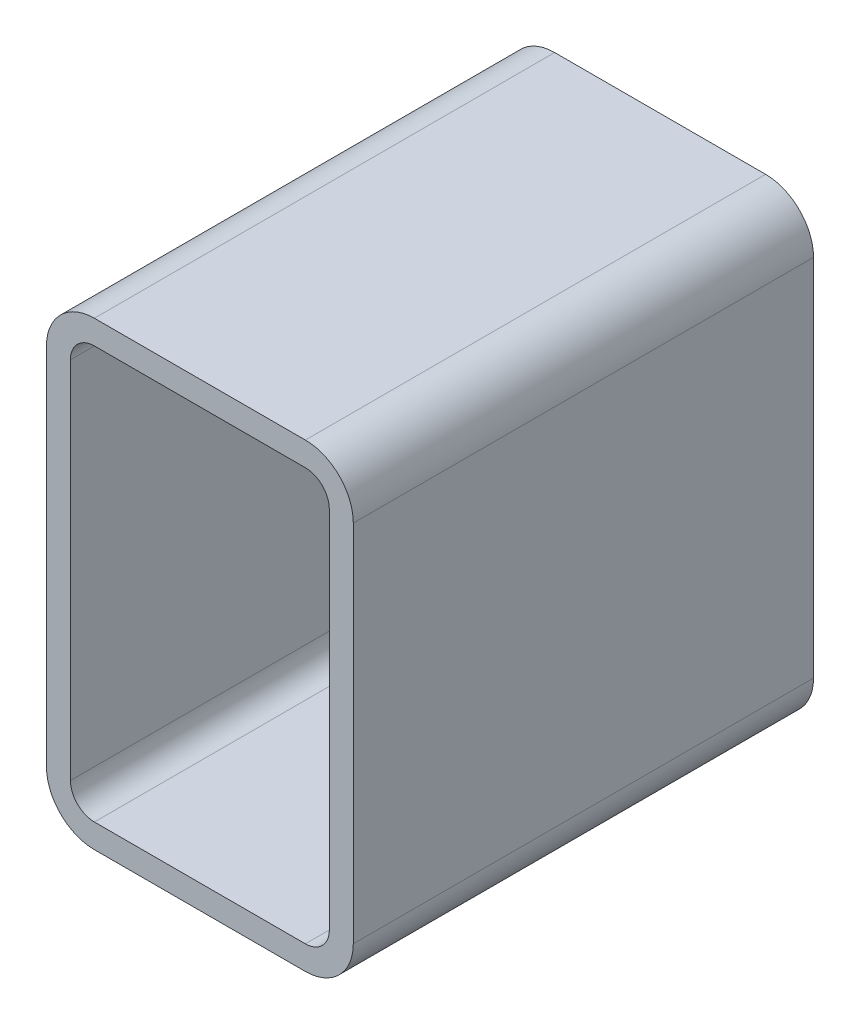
ISO-10303-21;
HEADER;
FILE_DESCRIPTION(('STEP AP214'),'2;1');
FILE_NAME('part.step','',(''),(''),'','','');
FILE_SCHEMA(('AUTOMOTIVE_DESIGN { 1 0 10303 214 1 1 1 1 }'));
ENDSEC;
DATA;
#1=APPLICATION_CONTEXT('core data for automotive mechanical design processes');
#2=APPLICATION_PROTOCOL_DEFINITION('international standard','automotive_design',2000,#1);
#3=PRODUCT_CONTEXT('',#1,'mechanical');
#4=PRODUCT('Part','Part','',(#3));
#5=PRODUCT_RELATED_PRODUCT_CATEGORY('part','',(#4));
#6=PRODUCT_DEFINITION_FORMATION('','',#4);
#7=PRODUCT_DEFINITION_CONTEXT('part definition',#1,'design');
#8=PRODUCT_DEFINITION('design','',#6,#7);
#9=PRODUCT_DEFINITION_SHAPE('','',#8);
#10=(LENGTH_UNIT() NAMED_UNIT(*) SI_UNIT(.MILLI.,.METRE.));
#11=(NAMED_UNIT(*) PLANE_ANGLE_UNIT() SI_UNIT($,.RADIAN.));
#12=(NAMED_UNIT(*) SI_UNIT($,.STERADIAN.) SOLID_ANGLE_UNIT());
#13=UNCERTAINTY_MEASURE_WITH_UNIT(LENGTH_MEASURE(1.E-05),#10,'distance_accuracy_value','');
#14=(GEOMETRIC_REPRESENTATION_CONTEXT(3) GLOBAL_UNCERTAINTY_ASSIGNED_CONTEXT((#13)) GLOBAL_UNIT_ASSIGNED_CONTEXT((#10,
#11,#12)) REPRESENTATION_CONTEXT('',''));
#15=CARTESIAN_POINT('',(0.,0.,0.));
#16=DIRECTION('',(0.,0.,1.));
#17=DIRECTION('',(1.,0.,0.));
#18=AXIS2_PLACEMENT_3D('',#15,#16,#17);
#19=CARTESIAN_POINT('',(33.1409404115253,274.924496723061,304.8));
#20=DIRECTION('',(0.,0.,1.));
#21=DIRECTION('',(1.,0.,0.));
#22=AXIS2_PLACEMENT_3D('',#19,#20,#21);
#23=PLANE('',#22);
#24=CARTESIAN_POINT('',(33.1409404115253,274.924496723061,304.8));
#25=DIRECTION('',(0.,0.,1.));
#26=DIRECTION('',(1.,0.,0.));
#27=AXIS2_PLACEMENT_3D('',#24,#25,#26);
#28=CIRCLE('',#27,31.75);
#29=CARTESIAN_POINT('',(33.1409404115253,306.674496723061,304.8));
#30=VERTEX_POINT('',#29);
#31=CARTESIAN_POINT('',(1.3909404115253,274.924496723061,304.8));
#32=VERTEX_POINT('',#31);
#33=EDGE_CURVE('E211',#30,#32,#28,.T.);
#34=ORIENTED_EDGE('',*,*,#33,.T.);
#35=DIRECTION('',(0.,-1.,0.));
#36=VECTOR('',#35,1.);
#37=CARTESIAN_POINT('',(1.3909404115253,33.6244967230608,304.8));
#38=LINE('',#37,#36);
#39=CARTESIAN_POINT('',(1.3909404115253,33.6244967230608,304.8));
#40=VERTEX_POINT('',#39);
#41=EDGE_CURVE('E214',#32,#40,#38,.T.);
#42=ORIENTED_EDGE('',*,*,#41,.T.);
#43=CARTESIAN_POINT('',(33.1409404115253,33.6244967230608,304.8));
#44=DIRECTION('',(0.,0.,1.));
#45=DIRECTION('',(1.,0.,0.));
#46=AXIS2_PLACEMENT_3D('',#43,#44,#45);
#47=CIRCLE('',#46,31.75);
#48=CARTESIAN_POINT('',(33.1409404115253,1.87449672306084,304.8));
#49=VERTEX_POINT('',#48);
#50=EDGE_CURVE('E217',#40,#49,#47,.T.);
#51=ORIENTED_EDGE('',*,*,#50,.T.);
#52=DIRECTION('',(1.,0.,0.));
#53=VECTOR('',#52,1.);
#54=CARTESIAN_POINT('',(172.840940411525,1.87449672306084,304.8));
#55=LINE('',#54,#53);
#56=CARTESIAN_POINT('',(172.840940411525,1.87449672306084,304.8));
#57=VERTEX_POINT('',#56);
#58=EDGE_CURVE('E219',#49,#57,#55,.T.);
#59=ORIENTED_EDGE('',*,*,#58,.T.);
#60=CARTESIAN_POINT('',(172.840940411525,33.6244967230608,304.8));
#61=DIRECTION('',(0.,0.,1.));
#62=DIRECTION('',(1.,0.,0.));
#63=AXIS2_PLACEMENT_3D('',#60,#61,#62);
#64=CIRCLE('',#63,31.75);
#65=CARTESIAN_POINT('',(204.590940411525,33.6244967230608,304.8));
#66=VERTEX_POINT('',#65);
#67=EDGE_CURVE('E221',#57,#66,#64,.T.);
#68=ORIENTED_EDGE('',*,*,#67,.T.);
#69=DIRECTION('',(0.,1.,0.));
#70=VECTOR('',#69,1.);
#71=CARTESIAN_POINT('',(204.590940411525,274.924496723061,304.8));
#72=LINE('',#71,#70);
#73=CARTESIAN_POINT('',(204.590940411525,274.924496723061,304.8));
#74=VERTEX_POINT('',#73);
#75=EDGE_CURVE('E223',#66,#74,#72,.T.);
#76=ORIENTED_EDGE('',*,*,#75,.T.);
#77=CARTESIAN_POINT('',(172.840940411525,274.924496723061,304.8));
#78=DIRECTION('',(0.,0.,1.));
#79=DIRECTION('',(1.,0.,0.));
#80=AXIS2_PLACEMENT_3D('',#77,#78,#79);
#81=CIRCLE('',#80,31.75);
#82=CARTESIAN_POINT('',(172.840940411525,306.674496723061,304.8));
#83=VERTEX_POINT('',#82);
#84=EDGE_CURVE('E225',#74,#83,#81,.T.);
#85=ORIENTED_EDGE('',*,*,#84,.T.);
#86=DIRECTION('',(-1.,0.,0.));
#87=VECTOR('',#86,1.);
#88=CARTESIAN_POINT('',(33.1409404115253,306.674496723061,304.8));
#89=LINE('',#88,#87);
#90=EDGE_CURVE('E227',#83,#30,#89,.T.);
#91=ORIENTED_EDGE('',*,*,#90,.T.);
#92=EDGE_LOOP('',(#34,#42,#51,#59,#68,#76,#85,#91));
#93=FACE_BOUND('',#92,.T.);
#94=DIRECTION('',(0.,-1.,0.));
#95=VECTOR('',#94,1.);
#96=CARTESIAN_POINT('',(17.2659404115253,33.6244967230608,304.8));
#97=LINE('',#96,#95);
#98=CARTESIAN_POINT('',(17.2659404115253,274.924496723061,304.8));
#99=VERTEX_POINT('',#98);
#100=CARTESIAN_POINT('',(17.2659404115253,33.6244967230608,304.8));
#101=VERTEX_POINT('',#100);
#102=EDGE_CURVE('E154',#99,#101,#97,.T.);
#103=ORIENTED_EDGE('',*,*,#102,.F.);
#104=CARTESIAN_POINT('',(33.1409404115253,274.924496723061,304.8));
#105=DIRECTION('',(0.,0.,1.));
#106=DIRECTION('',(1.,0.,0.));
#107=AXIS2_PLACEMENT_3D('',#104,#105,#106);
#108=CIRCLE('',#107,15.875);
#109=CARTESIAN_POINT('',(33.1409404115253,290.799496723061,304.8));
#110=VERTEX_POINT('',#109);
#111=EDGE_CURVE('E146',#110,#99,#108,.T.);
#112=ORIENTED_EDGE('',*,*,#111,.F.);
#113=DIRECTION('',(-1.,0.,0.));
#114=VECTOR('',#113,1.);
#115=CARTESIAN_POINT('',(33.1409404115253,290.799496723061,304.8));
#116=LINE('',#115,#114);
#117=CARTESIAN_POINT('',(172.840940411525,290.799496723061,304.8));
#118=VERTEX_POINT('',#117);
#119=EDGE_CURVE('E179',#118,#110,#116,.T.);
#120=ORIENTED_EDGE('',*,*,#119,.F.);
#121=CARTESIAN_POINT('',(172.840940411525,274.924496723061,304.8));
#122=DIRECTION('',(0.,0.,1.));
#123=DIRECTION('',(1.,0.,0.));
#124=AXIS2_PLACEMENT_3D('',#121,#122,#123);
#125=CIRCLE('',#124,15.875);
#126=CARTESIAN_POINT('',(188.715940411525,274.924496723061,304.8));
#127=VERTEX_POINT('',#126);
#128=EDGE_CURVE('E177',#127,#118,#125,.T.);
#129=ORIENTED_EDGE('',*,*,#128,.F.);
#130=DIRECTION('',(0.,1.,0.));
#131=VECTOR('',#130,1.);
#132=CARTESIAN_POINT('',(188.715940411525,274.924496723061,304.8));
#133=LINE('',#132,#131);
#134=CARTESIAN_POINT('',(188.715940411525,33.6244967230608,304.8));
#135=VERTEX_POINT('',#134);
#136=EDGE_CURVE('E175',#135,#127,#133,.T.);
#137=ORIENTED_EDGE('',*,*,#136,.F.);
#138=CARTESIAN_POINT('',(172.840940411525,33.6244967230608,304.8));
#139=DIRECTION('',(0.,0.,1.));
#140=DIRECTION('',(1.,0.,0.));
#141=AXIS2_PLACEMENT_3D('',#138,#139,#140);
#142=CIRCLE('',#141,15.875);
#143=CARTESIAN_POINT('',(172.840940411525,17.7494967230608,304.8));
#144=VERTEX_POINT('',#143);
#145=EDGE_CURVE('E173',#144,#135,#142,.T.);
#146=ORIENTED_EDGE('',*,*,#145,.F.);
#147=DIRECTION('',(1.,0.,0.));
#148=VECTOR('',#147,1.);
#149=CARTESIAN_POINT('',(172.840940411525,17.7494967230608,304.8));
#150=LINE('',#149,#148);
#151=CARTESIAN_POINT('',(33.1409404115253,17.7494967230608,304.8));
#152=VERTEX_POINT('',#151);
#153=EDGE_CURVE('E169',#152,#144,#150,.T.);
#154=ORIENTED_EDGE('',*,*,#153,.F.);
#155=CARTESIAN_POINT('',(33.1409404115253,33.6244967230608,304.8));
#156=DIRECTION('',(0.,0.,1.));
#157=DIRECTION('',(1.,0.,0.));
#158=AXIS2_PLACEMENT_3D('',#155,#156,#157);
#159=CIRCLE('',#158,15.875);
#160=EDGE_CURVE('E167',#101,#152,#159,.T.);
#161=ORIENTED_EDGE('',*,*,#160,.F.);
#162=EDGE_LOOP('',(#103,#112,#120,#129,#137,#146,#154,#161));
#163=FACE_BOUND('',#162,.T.);
#164=ADVANCED_FACE('F33',(#93,#163),#23,.T.);
#165=CARTESIAN_POINT('',(33.1409404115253,274.924496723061,0.));
#166=DIRECTION('',(0.,0.,1.));
#167=DIRECTION('',(1.,0.,0.));
#168=AXIS2_PLACEMENT_3D('',#165,#166,#167);
#169=PLANE('',#168);
#170=CARTESIAN_POINT('',(33.1409404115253,274.924496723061,0.));
#171=DIRECTION('',(0.,0.,1.));
#172=DIRECTION('',(1.,0.,0.));
#173=AXIS2_PLACEMENT_3D('',#170,#171,#172);
#174=CIRCLE('',#173,31.75);
#175=CARTESIAN_POINT('',(33.1409404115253,306.674496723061,0.));
#176=VERTEX_POINT('',#175);
#177=CARTESIAN_POINT('',(1.3909404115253,274.924496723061,0.));
#178=VERTEX_POINT('',#177);
#179=EDGE_CURVE('E162',#176,#178,#174,.T.);
#180=ORIENTED_EDGE('',*,*,#179,.F.);
#181=DIRECTION('',(-1.,0.,0.));
#182=VECTOR('',#181,1.);
#183=CARTESIAN_POINT('',(33.1409404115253,306.674496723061,0.));
#184=LINE('',#183,#182);
#185=CARTESIAN_POINT('',(172.840940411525,306.674496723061,0.));
#186=VERTEX_POINT('',#185);
#187=EDGE_CURVE('E215',#186,#176,#184,.T.);
#188=ORIENTED_EDGE('',*,*,#187,.F.);
#189=CARTESIAN_POINT('',(172.840940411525,274.924496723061,0.));
#190=DIRECTION('',(0.,0.,1.));
#191=DIRECTION('',(1.,0.,0.));
#192=AXIS2_PLACEMENT_3D('',#189,#190,#191);
#193=CIRCLE('',#192,31.75);
#194=CARTESIAN_POINT('',(204.590940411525,274.924496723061,0.));
#195=VERTEX_POINT('',#194);
#196=EDGE_CURVE('E242',#195,#186,#193,.T.);
#197=ORIENTED_EDGE('',*,*,#196,.F.);
#198=DIRECTION('',(0.,1.,0.));
#199=VECTOR('',#198,1.);
#200=CARTESIAN_POINT('',(204.590940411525,274.924496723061,0.));
#201=LINE('',#200,#199);
#202=CARTESIAN_POINT('',(204.590940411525,33.6244967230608,0.));
#203=VERTEX_POINT('',#202);
#204=EDGE_CURVE('E240',#203,#195,#201,.T.);
#205=ORIENTED_EDGE('',*,*,#204,.F.);
#206=CARTESIAN_POINT('',(172.840940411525,33.6244967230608,0.));
#207=DIRECTION('',(0.,0.,1.));
#208=DIRECTION('',(1.,0.,0.));
#209=AXIS2_PLACEMENT_3D('',#206,#207,#208);
#210=CIRCLE('',#209,31.75);
#211=CARTESIAN_POINT('',(172.840940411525,1.87449672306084,0.));
#212=VERTEX_POINT('',#211);
#213=EDGE_CURVE('E238',#212,#203,#210,.T.);
#214=ORIENTED_EDGE('',*,*,#213,.F.);
#215=DIRECTION('',(1.,0.,0.));
#216=VECTOR('',#215,1.);
#217=CARTESIAN_POINT('',(172.840940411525,1.87449672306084,0.));
#218=LINE('',#217,#216);
#219=CARTESIAN_POINT('',(33.1409404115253,1.87449672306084,0.));
#220=VERTEX_POINT('',#219);
#221=EDGE_CURVE('E236',#220,#212,#218,.T.);
#222=ORIENTED_EDGE('',*,*,#221,.F.);
#223=CARTESIAN_POINT('',(33.1409404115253,33.6244967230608,0.));
#224=DIRECTION('',(0.,0.,1.));
#225=DIRECTION('',(1.,0.,0.));
#226=AXIS2_PLACEMENT_3D('',#223,#224,#225);
#227=CIRCLE('',#226,31.75);
#228=CARTESIAN_POINT('',(1.3909404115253,33.6244967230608,0.));
#229=VERTEX_POINT('',#228);
#230=EDGE_CURVE('E234',#229,#220,#227,.T.);
#231=ORIENTED_EDGE('',*,*,#230,.F.);
#232=DIRECTION('',(0.,-1.,0.));
#233=VECTOR('',#232,1.);
#234=CARTESIAN_POINT('',(1.3909404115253,33.6244967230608,0.));
#235=LINE('',#234,#233);
#236=EDGE_CURVE('E232',#178,#229,#235,.T.);
#237=ORIENTED_EDGE('',*,*,#236,.F.);
#238=EDGE_LOOP('',(#180,#188,#197,#205,#214,#222,#231,#237));
#239=FACE_BOUND('',#238,.T.);
#240=CARTESIAN_POINT('',(33.1409404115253,274.924496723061,0.));
#241=DIRECTION('',(0.,0.,1.));
#242=DIRECTION('',(1.,0.,0.));
#243=AXIS2_PLACEMENT_3D('',#240,#241,#242);
#244=CIRCLE('',#243,15.875);
#245=CARTESIAN_POINT('',(33.1409404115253,290.799496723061,0.));
#246=VERTEX_POINT('',#245);
#247=CARTESIAN_POINT('',(17.2659404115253,274.924496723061,0.));
#248=VERTEX_POINT('',#247);
#249=EDGE_CURVE('E56',#246,#248,#244,.T.);
#250=ORIENTED_EDGE('',*,*,#249,.T.);
#251=DIRECTION('',(0.,-1.,0.));
#252=VECTOR('',#251,1.);
#253=CARTESIAN_POINT('',(17.2659404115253,33.6244967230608,0.));
#254=LINE('',#253,#252);
#255=CARTESIAN_POINT('',(17.2659404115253,33.6244967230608,0.));
#256=VERTEX_POINT('',#255);
#257=EDGE_CURVE('E161',#248,#256,#254,.T.);
#258=ORIENTED_EDGE('',*,*,#257,.T.);
#259=CARTESIAN_POINT('',(33.1409404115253,33.6244967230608,0.));
#260=DIRECTION('',(0.,0.,1.));
#261=DIRECTION('',(1.,0.,0.));
#262=AXIS2_PLACEMENT_3D('',#259,#260,#261);
#263=CIRCLE('',#262,15.875);
#264=CARTESIAN_POINT('',(33.1409404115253,17.7494967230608,0.));
#265=VERTEX_POINT('',#264);
#266=EDGE_CURVE('E183',#256,#265,#263,.T.);
#267=ORIENTED_EDGE('',*,*,#266,.T.);
#268=DIRECTION('',(1.,0.,0.));
#269=VECTOR('',#268,1.);
#270=CARTESIAN_POINT('',(172.840940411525,17.7494967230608,0.));
#271=LINE('',#270,#269);
#272=CARTESIAN_POINT('',(172.840940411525,17.7494967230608,0.));
#273=VERTEX_POINT('',#272);
#274=EDGE_CURVE('E186',#265,#273,#271,.T.);
#275=ORIENTED_EDGE('',*,*,#274,.T.);
#276=CARTESIAN_POINT('',(172.840940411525,33.6244967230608,0.));
#277=DIRECTION('',(0.,0.,1.));
#278=DIRECTION('',(1.,0.,0.));
#279=AXIS2_PLACEMENT_3D('',#276,#277,#278);
#280=CIRCLE('',#279,15.875);
#281=CARTESIAN_POINT('',(188.715940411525,33.6244967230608,0.));
#282=VERTEX_POINT('',#281);
#283=EDGE_CURVE('E189',#273,#282,#280,.T.);
#284=ORIENTED_EDGE('',*,*,#283,.T.);
#285=DIRECTION('',(0.,1.,0.));
#286=VECTOR('',#285,1.);
#287=CARTESIAN_POINT('',(188.715940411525,274.924496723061,0.));
#288=LINE('',#287,#286);
#289=CARTESIAN_POINT('',(188.715940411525,274.924496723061,0.));
#290=VERTEX_POINT('',#289);
#291=EDGE_CURVE('E192',#282,#290,#288,.T.);
#292=ORIENTED_EDGE('',*,*,#291,.T.);
#293=CARTESIAN_POINT('',(172.840940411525,274.924496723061,0.));
#294=DIRECTION('',(0.,0.,1.));
#295=DIRECTION('',(1.,0.,0.));
#296=AXIS2_PLACEMENT_3D('',#293,#294,#295);
#297=CIRCLE('',#296,15.875);
#298=CARTESIAN_POINT('',(172.840940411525,290.799496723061,0.));
#299=VERTEX_POINT('',#298);
#300=EDGE_CURVE('E195',#290,#299,#297,.T.);
#301=ORIENTED_EDGE('',*,*,#300,.T.);
#302=DIRECTION('',(-1.,0.,0.));
#303=VECTOR('',#302,1.);
#304=CARTESIAN_POINT('',(33.1409404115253,290.799496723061,0.));
#305=LINE('',#304,#303);
#306=EDGE_CURVE('E155',#299,#246,#305,.T.);
#307=ORIENTED_EDGE('',*,*,#306,.T.);
#308=EDGE_LOOP('',(#250,#258,#267,#275,#284,#292,#301,#307));
#309=FACE_BOUND('',#308,.T.);
#310=ADVANCED_FACE('F272',(#239,#309),#169,.F.);
#311=CARTESIAN_POINT('',(33.1409404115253,274.924496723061,304.8));
#312=DIRECTION('',(0.,0.,-1.));
#313=DIRECTION('',(-1.,0.,0.));
#314=AXIS2_PLACEMENT_3D('',#311,#312,#313);
#315=CYLINDRICAL_SURFACE('',#314,31.75);
#316=ORIENTED_EDGE('',*,*,#179,.T.);
#317=DIRECTION('',(0.,0.,-1.));
#318=VECTOR('',#317,1.);
#319=CARTESIAN_POINT('',(1.3909404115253,274.924496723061,304.8));
#320=LINE('',#319,#318);
#321=EDGE_CURVE('E11',#32,#178,#320,.T.);
#322=ORIENTED_EDGE('',*,*,#321,.F.);
#323=ORIENTED_EDGE('',*,*,#33,.F.);
#324=DIRECTION('',(0.,0.,-1.));
#325=VECTOR('',#324,1.);
#326=CARTESIAN_POINT('',(33.1409404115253,306.674496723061,304.8));
#327=LINE('',#326,#325);
#328=EDGE_CURVE('E229',#30,#176,#327,.T.);
#329=ORIENTED_EDGE('',*,*,#328,.T.);
#330=EDGE_LOOP('',(#316,#322,#323,#329));
#331=FACE_BOUND('',#330,.T.);
#332=ADVANCED_FACE('F35',(#331),#315,.T.);
#333=CARTESIAN_POINT('',(1.3909404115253,33.6244967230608,304.8));
#334=DIRECTION('',(1.,0.,0.));
#335=DIRECTION('',(0.,0.,-1.));
#336=AXIS2_PLACEMENT_3D('',#333,#334,#335);
#337=PLANE('',#336);
#338=ORIENTED_EDGE('',*,*,#236,.T.);
#339=DIRECTION('',(0.,0.,-1.));
#340=VECTOR('',#339,1.);
#341=CARTESIAN_POINT('',(1.3909404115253,33.6244967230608,304.8));
#342=LINE('',#341,#340);
#343=EDGE_CURVE('E41',#40,#229,#342,.T.);
#344=ORIENTED_EDGE('',*,*,#343,.F.);
#345=ORIENTED_EDGE('',*,*,#41,.F.);
#346=ORIENTED_EDGE('',*,*,#321,.T.);
#347=EDGE_LOOP('',(#338,#344,#345,#346));
#348=FACE_BOUND('',#347,.T.);
#349=ADVANCED_FACE('F289',(#348),#337,.F.);
#350=CARTESIAN_POINT('',(33.1409404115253,33.6244967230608,304.8));
#351=DIRECTION('',(0.,0.,-1.));
#352=DIRECTION('',(-1.,0.,0.));
#353=AXIS2_PLACEMENT_3D('',#350,#351,#352);
#354=CYLINDRICAL_SURFACE('',#353,31.75);
#355=ORIENTED_EDGE('',*,*,#230,.T.);
#356=DIRECTION('',(0.,0.,-1.));
#357=VECTOR('',#356,1.);
#358=CARTESIAN_POINT('',(33.1409404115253,1.87449672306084,304.8));
#359=LINE('',#358,#357);
#360=EDGE_CURVE('E259',#49,#220,#359,.T.);
#361=ORIENTED_EDGE('',*,*,#360,.F.);
#362=ORIENTED_EDGE('',*,*,#50,.F.);
#363=ORIENTED_EDGE('',*,*,#343,.T.);
#364=EDGE_LOOP('',(#355,#361,#362,#363));
#365=FACE_BOUND('',#364,.T.);
#366=ADVANCED_FACE('F266',(#365),#354,.T.);
#367=CARTESIAN_POINT('',(172.840940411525,1.87449672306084,304.8));
#368=DIRECTION('',(0.,1.,0.));
#369=DIRECTION('',(0.,0.,1.));
#370=AXIS2_PLACEMENT_3D('',#367,#368,#369);
#371=PLANE('',#370);
#372=ORIENTED_EDGE('',*,*,#221,.T.);
#373=DIRECTION('',(0.,0.,-1.));
#374=VECTOR('',#373,1.);
#375=CARTESIAN_POINT('',(172.840940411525,1.87449672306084,304.8));
#376=LINE('',#375,#374);
#377=EDGE_CURVE('E256',#57,#212,#376,.T.);
#378=ORIENTED_EDGE('',*,*,#377,.F.);
#379=ORIENTED_EDGE('',*,*,#58,.F.);
#380=ORIENTED_EDGE('',*,*,#360,.T.);
#381=EDGE_LOOP('',(#372,#378,#379,#380));
#382=FACE_BOUND('',#381,.T.);
#383=ADVANCED_FACE('F278',(#382),#371,.F.);
#384=CARTESIAN_POINT('',(172.840940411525,33.6244967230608,304.8));
#385=DIRECTION('',(0.,0.,-1.));
#386=DIRECTION('',(-1.,0.,0.));
#387=AXIS2_PLACEMENT_3D('',#384,#385,#386);
#388=CYLINDRICAL_SURFACE('',#387,31.75);
#389=ORIENTED_EDGE('',*,*,#213,.T.);
#390=DIRECTION('',(0.,0.,-1.));
#391=VECTOR('',#390,1.);
#392=CARTESIAN_POINT('',(204.590940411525,33.6244967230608,304.8));
#393=LINE('',#392,#391);
#394=EDGE_CURVE('E253',#66,#203,#393,.T.);
#395=ORIENTED_EDGE('',*,*,#394,.F.);
#396=ORIENTED_EDGE('',*,*,#67,.F.);
#397=ORIENTED_EDGE('',*,*,#377,.T.);
#398=EDGE_LOOP('',(#389,#395,#396,#397));
#399=FACE_BOUND('',#398,.T.);
#400=ADVANCED_FACE('F282',(#399),#388,.T.);
#401=CARTESIAN_POINT('',(204.590940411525,274.924496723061,304.8));
#402=DIRECTION('',(-1.,0.,0.));
#403=DIRECTION('',(0.,0.,1.));
#404=AXIS2_PLACEMENT_3D('',#401,#402,#403);
#405=PLANE('',#404);
#406=ORIENTED_EDGE('',*,*,#204,.T.);
#407=DIRECTION('',(0.,0.,-1.));
#408=VECTOR('',#407,1.);
#409=CARTESIAN_POINT('',(204.590940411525,274.924496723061,304.8));
#410=LINE('',#409,#408);
#411=EDGE_CURVE('E250',#74,#195,#410,.T.);
#412=ORIENTED_EDGE('',*,*,#411,.F.);
#413=ORIENTED_EDGE('',*,*,#75,.F.);
#414=ORIENTED_EDGE('',*,*,#394,.T.);
#415=EDGE_LOOP('',(#406,#412,#413,#414));
#416=FACE_BOUND('',#415,.T.);
#417=ADVANCED_FACE('F302',(#416),#405,.F.);
#418=CARTESIAN_POINT('',(172.840940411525,274.924496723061,304.8));
#419=DIRECTION('',(0.,0.,-1.));
#420=DIRECTION('',(-1.,0.,0.));
#421=AXIS2_PLACEMENT_3D('',#418,#419,#420);
#422=CYLINDRICAL_SURFACE('',#421,31.75);
#423=ORIENTED_EDGE('',*,*,#196,.T.);
#424=DIRECTION('',(0.,0.,-1.));
#425=VECTOR('',#424,1.);
#426=CARTESIAN_POINT('',(172.840940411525,306.674496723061,304.8));
#427=LINE('',#426,#425);
#428=EDGE_CURVE('E247',#83,#186,#427,.T.);
#429=ORIENTED_EDGE('',*,*,#428,.F.);
#430=ORIENTED_EDGE('',*,*,#84,.F.);
#431=ORIENTED_EDGE('',*,*,#411,.T.);
#432=EDGE_LOOP('',(#423,#429,#430,#431));
#433=FACE_BOUND('',#432,.T.);
#434=ADVANCED_FACE('F300',(#433),#422,.T.);
#435=CARTESIAN_POINT('',(33.1409404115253,306.674496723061,304.8));
#436=DIRECTION('',(0.,-1.,0.));
#437=DIRECTION('',(0.,0.,-1.));
#438=AXIS2_PLACEMENT_3D('',#435,#436,#437);
#439=PLANE('',#438);
#440=ORIENTED_EDGE('',*,*,#187,.T.);
#441=ORIENTED_EDGE('',*,*,#328,.F.);
#442=ORIENTED_EDGE('',*,*,#90,.F.);
#443=ORIENTED_EDGE('',*,*,#428,.T.);
#444=EDGE_LOOP('',(#440,#441,#442,#443));
#445=FACE_BOUND('',#444,.T.);
#446=ADVANCED_FACE('F295',(#445),#439,.F.);
#447=CARTESIAN_POINT('',(33.1409404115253,274.924496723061,304.8));
#448=DIRECTION('',(0.,0.,-1.));
#449=DIRECTION('',(-1.,0.,0.));
#450=AXIS2_PLACEMENT_3D('',#447,#448,#449);
#451=CYLINDRICAL_SURFACE('',#450,15.875);
#452=ORIENTED_EDGE('',*,*,#249,.F.);
#453=DIRECTION('',(0.,0.,-1.));
#454=VECTOR('',#453,1.);
#455=CARTESIAN_POINT('',(33.1409404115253,290.799496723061,304.8));
#456=LINE('',#455,#454);
#457=EDGE_CURVE('E150',#110,#246,#456,.T.);
#458=ORIENTED_EDGE('',*,*,#457,.F.);
#459=ORIENTED_EDGE('',*,*,#111,.T.);
#460=DIRECTION('',(0.,0.,-1.));
#461=VECTOR('',#460,1.);
#462=CARTESIAN_POINT('',(17.2659404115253,274.924496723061,304.8));
#463=LINE('',#462,#461);
#464=EDGE_CURVE('E149',#99,#248,#463,.T.);
#465=ORIENTED_EDGE('',*,*,#464,.T.);
#466=EDGE_LOOP('',(#452,#458,#459,#465));
#467=FACE_BOUND('',#466,.T.);
#468=ADVANCED_FACE('F148',(#467),#451,.F.);
#469=CARTESIAN_POINT('',(17.2659404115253,33.6244967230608,304.8));
#470=DIRECTION('',(1.,0.,0.));
#471=DIRECTION('',(0.,0.,-1.));
#472=AXIS2_PLACEMENT_3D('',#469,#470,#471);
#473=PLANE('',#472);
#474=ORIENTED_EDGE('',*,*,#257,.F.);
#475=ORIENTED_EDGE('',*,*,#464,.F.);
#476=ORIENTED_EDGE('',*,*,#102,.T.);
#477=DIRECTION('',(0.,0.,-1.));
#478=VECTOR('',#477,1.);
#479=CARTESIAN_POINT('',(17.2659404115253,33.6244967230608,304.8));
#480=LINE('',#479,#478);
#481=EDGE_CURVE('E163',#101,#256,#480,.T.);
#482=ORIENTED_EDGE('',*,*,#481,.T.);
#483=EDGE_LOOP('',(#474,#475,#476,#482));
#484=FACE_BOUND('',#483,.T.);
#485=ADVANCED_FACE('F158',(#484),#473,.T.);
#486=CARTESIAN_POINT('',(33.1409404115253,33.6244967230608,304.8));
#487=DIRECTION('',(0.,0.,-1.));
#488=DIRECTION('',(-1.,0.,0.));
#489=AXIS2_PLACEMENT_3D('',#486,#487,#488);
#490=CYLINDRICAL_SURFACE('',#489,15.875);
#491=ORIENTED_EDGE('',*,*,#266,.F.);
#492=ORIENTED_EDGE('',*,*,#481,.F.);
#493=ORIENTED_EDGE('',*,*,#160,.T.);
#494=DIRECTION('',(0.,0.,-1.));
#495=VECTOR('',#494,1.);
#496=CARTESIAN_POINT('',(33.1409404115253,17.7494967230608,304.8));
#497=LINE('',#496,#495);
#498=EDGE_CURVE('E208',#152,#265,#497,.T.);
#499=ORIENTED_EDGE('',*,*,#498,.T.);
#500=EDGE_LOOP('',(#491,#492,#493,#499));
#501=FACE_BOUND('',#500,.T.);
#502=ADVANCED_FACE('F327',(#501),#490,.F.);
#503=CARTESIAN_POINT('',(172.840940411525,17.7494967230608,304.8));
#504=DIRECTION('',(0.,1.,0.));
#505=DIRECTION('',(0.,0.,1.));
#506=AXIS2_PLACEMENT_3D('',#503,#504,#505);
#507=PLANE('',#506);
#508=ORIENTED_EDGE('',*,*,#274,.F.);
#509=ORIENTED_EDGE('',*,*,#498,.F.);
#510=ORIENTED_EDGE('',*,*,#153,.T.);
#511=DIRECTION('',(0.,0.,-1.));
#512=VECTOR('',#511,1.);
#513=CARTESIAN_POINT('',(172.840940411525,17.7494967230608,304.8));
#514=LINE('',#513,#512);
#515=EDGE_CURVE('E206',#144,#273,#514,.T.);
#516=ORIENTED_EDGE('',*,*,#515,.T.);
#517=EDGE_LOOP('',(#508,#509,#510,#516));
#518=FACE_BOUND('',#517,.T.);
#519=ADVANCED_FACE('F331',(#518),#507,.T.);
#520=CARTESIAN_POINT('',(172.840940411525,33.6244967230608,304.8));
#521=DIRECTION('',(0.,0.,-1.));
#522=DIRECTION('',(-1.,0.,0.));
#523=AXIS2_PLACEMENT_3D('',#520,#521,#522);
#524=CYLINDRICAL_SURFACE('',#523,15.875);
#525=ORIENTED_EDGE('',*,*,#283,.F.);
#526=ORIENTED_EDGE('',*,*,#515,.F.);
#527=ORIENTED_EDGE('',*,*,#145,.T.);
#528=DIRECTION('',(0.,0.,-1.));
#529=VECTOR('',#528,1.);
#530=CARTESIAN_POINT('',(188.715940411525,33.6244967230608,304.8));
#531=LINE('',#530,#529);
#532=EDGE_CURVE('E204',#135,#282,#531,.T.);
#533=ORIENTED_EDGE('',*,*,#532,.T.);
#534=EDGE_LOOP('',(#525,#526,#527,#533));
#535=FACE_BOUND('',#534,.T.);
#536=ADVANCED_FACE('F337',(#535),#524,.F.);
#537=CARTESIAN_POINT('',(188.715940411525,274.924496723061,304.8));
#538=DIRECTION('',(-1.,0.,0.));
#539=DIRECTION('',(0.,0.,1.));
#540=AXIS2_PLACEMENT_3D('',#537,#538,#539);
#541=PLANE('',#540);
#542=ORIENTED_EDGE('',*,*,#291,.F.);
#543=ORIENTED_EDGE('',*,*,#532,.F.);
#544=ORIENTED_EDGE('',*,*,#136,.T.);
#545=DIRECTION('',(0.,0.,-1.));
#546=VECTOR('',#545,1.);
#547=CARTESIAN_POINT('',(188.715940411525,274.924496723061,304.8));
#548=LINE('',#547,#546);
#549=EDGE_CURVE('E202',#127,#290,#548,.T.);
#550=ORIENTED_EDGE('',*,*,#549,.T.);
#551=EDGE_LOOP('',(#542,#543,#544,#550));
#552=FACE_BOUND('',#551,.T.);
#553=ADVANCED_FACE('F341',(#552),#541,.T.);
#554=CARTESIAN_POINT('',(172.840940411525,274.924496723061,304.8));
#555=DIRECTION('',(0.,0.,-1.));
#556=DIRECTION('',(-1.,0.,0.));
#557=AXIS2_PLACEMENT_3D('',#554,#555,#556);
#558=CYLINDRICAL_SURFACE('',#557,15.875);
#559=ORIENTED_EDGE('',*,*,#300,.F.);
#560=ORIENTED_EDGE('',*,*,#549,.F.);
#561=ORIENTED_EDGE('',*,*,#128,.T.);
#562=DIRECTION('',(0.,0.,-1.));
#563=VECTOR('',#562,1.);
#564=CARTESIAN_POINT('',(172.840940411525,290.799496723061,304.8));
#565=LINE('',#564,#563);
#566=EDGE_CURVE('E48',#118,#299,#565,.T.);
#567=ORIENTED_EDGE('',*,*,#566,.T.);
#568=EDGE_LOOP('',(#559,#560,#561,#567));
#569=FACE_BOUND('',#568,.T.);
#570=ADVANCED_FACE('F345',(#569),#558,.F.);
#571=CARTESIAN_POINT('',(33.1409404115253,290.799496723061,304.8));
#572=DIRECTION('',(0.,-1.,0.));
#573=DIRECTION('',(0.,0.,-1.));
#574=AXIS2_PLACEMENT_3D('',#571,#572,#573);
#575=PLANE('',#574);
#576=ORIENTED_EDGE('',*,*,#306,.F.);
#577=ORIENTED_EDGE('',*,*,#566,.F.);
#578=ORIENTED_EDGE('',*,*,#119,.T.);
#579=ORIENTED_EDGE('',*,*,#457,.T.);
#580=EDGE_LOOP('',(#576,#577,#578,#579));
#581=FACE_BOUND('',#580,.T.);
#582=ADVANCED_FACE('F349',(#581),#575,.T.);
#583=CLOSED_SHELL('',(#164,#310,#332,#349,#366,#383,#400,#417,#434,#446,#468,#485,#502,#519,
#536,#553,#570,#582));
#584=MANIFOLD_SOLID_BREP('B2',#583);
#585=ADVANCED_BREP_SHAPE_REPRESENTATION('',(#18,#584),#14);
#586=SHAPE_DEFINITION_REPRESENTATION(#9,#585);
ENDSEC;
END-ISO-10303-21;
